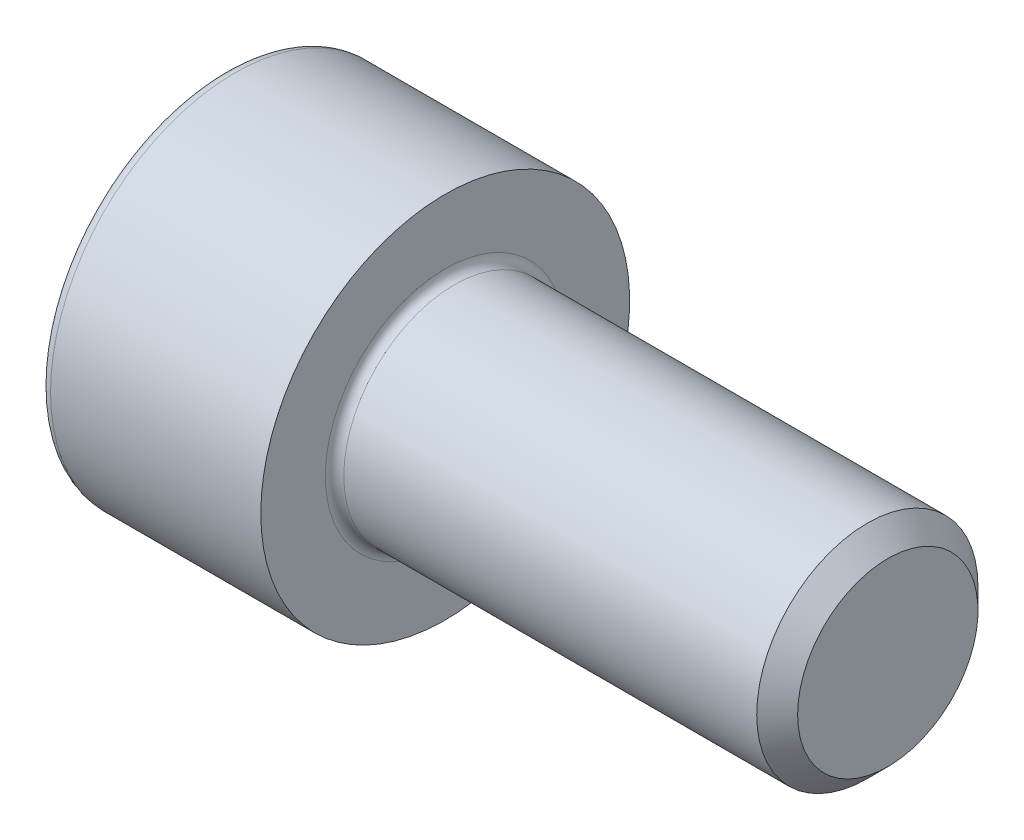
from build123d import *

# Parameters (mm, degrees)
FILLET1_R   = 0.25
FILLET2_R   = 0.3
HEX_2_DEPTH = 3


with BuildPart() as part:
    # BodySke → Base-Revolve (revolve)
    with BuildSketch(Plane.XY, mode=Mode.PRIVATE) as base_revolve_sk:
        Polygon((0, 0), (0, 5), (6, 5), (6, 3), (17.4455, 3), (18, 2.4455), (18, 0), align=None)
    revolve(base_revolve_sk.sketch.rotate(Axis((-31.75, 0, 0), (1, 0, 0)), 90), axis=Axis((-31.75, 0, 0), (1, 0, 0)))

    # Fillet1
    fillet1_edges = [part.edges().sort_by_distance(p)[0] for p in [
        (6, 0, -3),
    ]]
    fillet(fillet1_edges, radius=FILLET1_R)

    # Fillet2
    fillet2_edges = [part.edges().sort_by_distance(p)[0] for p in [
        (0, 0, -5),
    ]]
    fillet(fillet2_edges, radius=FILLET2_R)

    # Sketch2 → Hex-PreBroach (revolve, cut)
    with BuildSketch(Plane.XY, mode=Mode.PRIVATE) as hex_prebroach_sk:
        Polygon((0, 2.542), (3, 2.542), (4.467624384, 0), (0, 0), align=None)
    revolve(hex_prebroach_sk.sketch.rotate(Axis((0, 0, 0), (1, 0, 0)), 90), axis=Axis((0, 0, 0), (1, 0, 0)), mode=Mode.SUBTRACT)

    # Sketch3 → Hex 2 (cut)
    with BuildSketch(Plane(origin=(0, 0, 0), x_dir=(0, 0.500000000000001, 0.866025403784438), z_dir=(-1, 0, 0))):
        Polygon((1.467624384, 2.542), (-1.467624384, 2.542), (-2.935248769, 0), (-1.467624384, -2.542), (1.467624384, -2.542), (2.935248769, 0), align=None)
    extrude(amount=-HEX_2_DEPTH, mode=Mode.SUBTRACT)


solid = part.part
